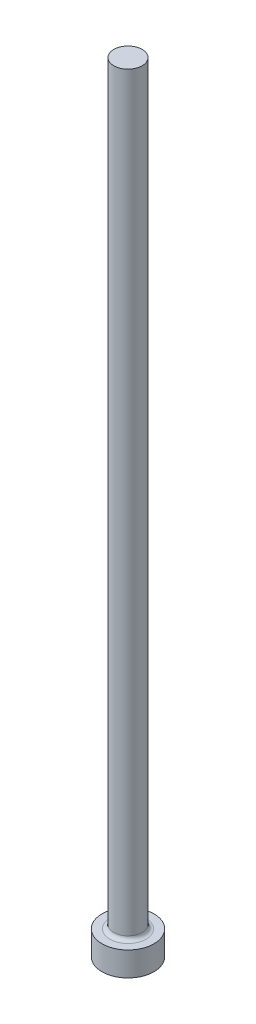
from build123d import *


with BuildPart() as part:
    # Sketch1 → Revolve1 (revolve)
    with BuildSketch(Plane.XY, mode=Mode.PRIVATE) as revolve1_sk:
        with BuildLine():
            Line((0, 0), (5.08, 0))
            Line((5.08, 0), (5.08, 4.7498))
            Line((5.08, 4.7498), (3.53949, 4.7498))
            ThreePointArc((3.53949, 4.7498), (3.000674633, 4.972984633), (2.77749, 5.5118))
            Line((2.77749, 5.5118), (2.77749, 152.4))
            Line((2.77749, 152.4), (0, 152.4))
            Line((0, 152.4), (0, 0))
        make_face()
    revolve(revolve1_sk.sketch.rotate(Axis((0, 152.4, 0), (0, -1, 0)), 180), axis=Axis((0, 152.4, 0), (0, -1, 0)))


solid = part.part
